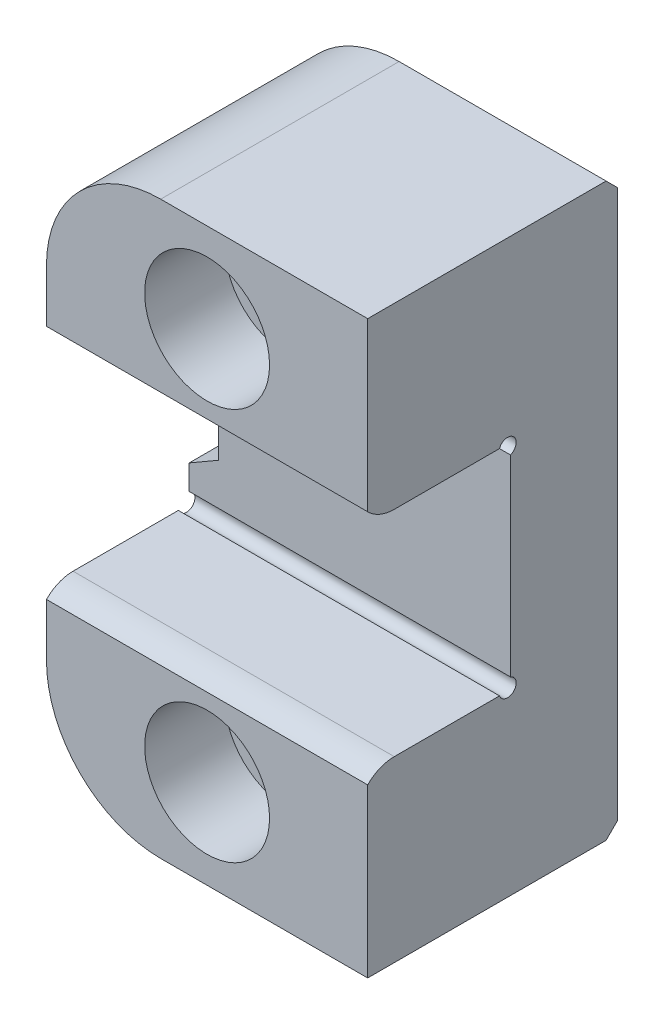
ISO-10303-21;
HEADER;
FILE_DESCRIPTION(('STEP AP214'),'2;1');
FILE_NAME('part.step','',(''),(''),'','','');
FILE_SCHEMA(('AUTOMOTIVE_DESIGN { 1 0 10303 214 1 1 1 1 }'));
ENDSEC;
DATA;
#1=APPLICATION_CONTEXT('core data for automotive mechanical design processes');
#2=APPLICATION_PROTOCOL_DEFINITION('international standard','automotive_design',2000,#1);
#3=PRODUCT_CONTEXT('',#1,'mechanical');
#4=PRODUCT('Part','Part','',(#3));
#5=PRODUCT_RELATED_PRODUCT_CATEGORY('part','',(#4));
#6=PRODUCT_DEFINITION_FORMATION('','',#4);
#7=PRODUCT_DEFINITION_CONTEXT('part definition',#1,'design');
#8=PRODUCT_DEFINITION('design','',#6,#7);
#9=PRODUCT_DEFINITION_SHAPE('','',#8);
#10=(LENGTH_UNIT() NAMED_UNIT(*) SI_UNIT(.MILLI.,.METRE.));
#11=(NAMED_UNIT(*) PLANE_ANGLE_UNIT() SI_UNIT($,.RADIAN.));
#12=(NAMED_UNIT(*) SI_UNIT($,.STERADIAN.) SOLID_ANGLE_UNIT());
#13=UNCERTAINTY_MEASURE_WITH_UNIT(LENGTH_MEASURE(1.E-05),#10,'distance_accuracy_value','');
#14=(GEOMETRIC_REPRESENTATION_CONTEXT(3) GLOBAL_UNCERTAINTY_ASSIGNED_CONTEXT((#13)) GLOBAL_UNIT_ASSIGNED_CONTEXT((#10,
#11,#12)) REPRESENTATION_CONTEXT('',''));
#15=CARTESIAN_POINT('',(0.,0.,0.));
#16=DIRECTION('',(0.,0.,1.));
#17=DIRECTION('',(1.,0.,0.));
#18=AXIS2_PLACEMENT_3D('',#15,#16,#17);
#19=CARTESIAN_POINT('',(14.2875,25.4,0.));
#20=DIRECTION('',(0.,0.,-1.));
#21=DIRECTION('',(0.,1.,0.));
#22=AXIS2_PLACEMENT_3D('',#19,#20,#21);
#23=PLANE('',#22);
#24=DIRECTION('',(0.,-1.,0.));
#25=VECTOR('',#24,1.);
#26=CARTESIAN_POINT('',(-14.2875,25.4,0.));
#27=LINE('',#26,#25);
#28=CARTESIAN_POINT('',(-14.2875,15.24,0.));
#29=VERTEX_POINT('',#28);
#30=CARTESIAN_POINT('',(-14.2875,10.5210198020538,0.));
#31=VERTEX_POINT('',#30);
#32=EDGE_CURVE('E342',#29,#31,#27,.T.);
#33=ORIENTED_EDGE('',*,*,#32,.T.);
#34=DIRECTION('',(1.,0.,0.));
#35=VECTOR('',#34,1.);
#36=CARTESIAN_POINT('',(-14.2875,10.5210198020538,0.));
#37=LINE('',#36,#35);
#38=CARTESIAN_POINT('',(14.2875,10.5210198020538,0.));
#39=VERTEX_POINT('',#38);
#40=EDGE_CURVE('E411',#31,#39,#37,.T.);
#41=ORIENTED_EDGE('',*,*,#40,.T.);
#42=DIRECTION('',(0.,-1.,0.));
#43=VECTOR('',#42,1.);
#44=CARTESIAN_POINT('',(14.2875,25.4,0.));
#45=LINE('',#44,#43);
#46=CARTESIAN_POINT('',(14.2875,25.4,0.));
#47=VERTEX_POINT('',#46);
#48=EDGE_CURVE('E218',#47,#39,#45,.T.);
#49=ORIENTED_EDGE('',*,*,#48,.F.);
#50=DIRECTION('',(-1.,0.,0.));
#51=VECTOR('',#50,1.);
#52=CARTESIAN_POINT('',(14.2875,25.4,0.));
#53=LINE('',#52,#51);
#54=CARTESIAN_POINT('',(-4.1275,25.4,0.));
#55=VERTEX_POINT('',#54);
#56=EDGE_CURVE('E225',#47,#55,#53,.T.);
#57=ORIENTED_EDGE('',*,*,#56,.T.);
#58=CARTESIAN_POINT('',(-4.1275,15.24,0.));
#59=DIRECTION('',(0.,0.,-1.));
#60=DIRECTION('',(0.,1.,0.));
#61=AXIS2_PLACEMENT_3D('',#58,#59,#60);
#62=CIRCLE('',#61,10.16);
#63=EDGE_CURVE('E243',#55,#29,#62,.F.);
#64=ORIENTED_EDGE('',*,*,#63,.T.);
#65=EDGE_LOOP('',(#33,#41,#49,#57,#64));
#66=FACE_BOUND('',#65,.T.);
#67=CARTESIAN_POINT('',(0.,17.4625,0.));
#68=DIRECTION('',(0.,0.,1.));
#69=DIRECTION('',(1.,0.,0.));
#70=AXIS2_PLACEMENT_3D('',#67,#68,#69);
#71=CIRCLE('',#70,5.55625);
#72=CARTESIAN_POINT('',(5.55625,17.4625,0.));
#73=VERTEX_POINT('',#72);
#74=EDGE_CURVE('E298',#73,#73,#71,.T.);
#75=ORIENTED_EDGE('',*,*,#74,.F.);
#76=EDGE_LOOP('',(#75));
#77=FACE_BOUND('',#76,.T.);
#78=ADVANCED_FACE('F32',(#66,#77),#23,.F.);
#79=CARTESIAN_POINT('',(14.2875,9.525,-12.7));
#80=DIRECTION('',(0.,0.,-1.));
#81=DIRECTION('',(-1.,0.,0.));
#82=AXIS2_PLACEMENT_3D('',#79,#80,#81);
#83=PLANE('',#82);
#84=DIRECTION('',(-0.866025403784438,0.500000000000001,0.));
#85=VECTOR('',#84,1.);
#86=CARTESIAN_POINT('',(5.76893467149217,-5.22958795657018,-12.7));
#87=LINE('',#86,#85);
#88=CARTESIAN_POINT('',(-11.6791135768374,4.84404739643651,-12.7));
#89=VERTEX_POINT('',#88);
#90=CARTESIAN_POINT('',(-14.2875,6.35,-12.7));
#91=VERTEX_POINT('',#90);
#92=EDGE_CURVE('E340',#89,#91,#87,.T.);
#93=ORIENTED_EDGE('',*,*,#92,.F.);
#94=DIRECTION('',(0.,-1.,0.));
#95=VECTOR('',#94,1.);
#96=CARTESIAN_POINT('',(-11.6791135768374,-5.43345644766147,-12.7));
#97=LINE('',#96,#95);
#98=CARTESIAN_POINT('',(-11.6791135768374,-4.84404739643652,-12.7));
#99=VERTEX_POINT('',#98);
#100=EDGE_CURVE('E255',#89,#99,#97,.T.);
#101=ORIENTED_EDGE('',*,*,#100,.T.);
#102=DIRECTION('',(0.866025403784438,0.500000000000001,0.));
#103=VECTOR('',#102,1.);
#104=CARTESIAN_POINT('',(14.017826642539,9.9920879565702,-12.7));
#105=LINE('',#104,#103);
#106=CARTESIAN_POINT('',(-14.2875,-6.35,-12.7));
#107=VERTEX_POINT('',#106);
#108=EDGE_CURVE('E338',#107,#99,#105,.T.);
#109=ORIENTED_EDGE('',*,*,#108,.F.);
#110=DIRECTION('',(0.,-1.,0.));
#111=VECTOR('',#110,1.);
#112=CARTESIAN_POINT('',(-14.2875,9.525,-12.7));
#113=LINE('',#112,#111);
#114=CARTESIAN_POINT('',(-14.2875,-8.55257951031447,-12.7));
#115=VERTEX_POINT('',#114);
#116=EDGE_CURVE('E221',#107,#115,#113,.T.);
#117=ORIENTED_EDGE('',*,*,#116,.T.);
#118=DIRECTION('',(1.,0.,0.));
#119=VECTOR('',#118,1.);
#120=CARTESIAN_POINT('',(-14.2875,-8.55257951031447,-12.7));
#121=LINE('',#120,#119);
#122=CARTESIAN_POINT('',(14.2875,-8.55257951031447,-12.7));
#123=VERTEX_POINT('',#122);
#124=EDGE_CURVE('E194',#115,#123,#121,.T.);
#125=ORIENTED_EDGE('',*,*,#124,.T.);
#126=DIRECTION('',(0.,-1.,0.));
#127=VECTOR('',#126,1.);
#128=CARTESIAN_POINT('',(14.2875,9.525,-12.7));
#129=LINE('',#128,#127);
#130=CARTESIAN_POINT('',(14.2875,8.55257951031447,-12.7));
#131=VERTEX_POINT('',#130);
#132=EDGE_CURVE('E348',#131,#123,#129,.T.);
#133=ORIENTED_EDGE('',*,*,#132,.F.);
#134=DIRECTION('',(1.,0.,0.));
#135=VECTOR('',#134,1.);
#136=CARTESIAN_POINT('',(-14.2875,8.55257951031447,-12.7));
#137=LINE('',#136,#135);
#138=CARTESIAN_POINT('',(-14.2875,8.55257951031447,-12.7));
#139=VERTEX_POINT('',#138);
#140=EDGE_CURVE('E417',#131,#139,#137,.F.);
#141=ORIENTED_EDGE('',*,*,#140,.T.);
#142=EDGE_CURVE('E215',#139,#91,#113,.T.);
#143=ORIENTED_EDGE('',*,*,#142,.T.);
#144=EDGE_LOOP('',(#93,#101,#109,#117,#125,#133,#141,#143));
#145=FACE_BOUND('',#144,.T.);
#146=ADVANCED_FACE('F370',(#145),#83,.F.);
#147=CARTESIAN_POINT('',(14.2875,25.4,-22.225));
#148=DIRECTION('',(0.,0.,1.));
#149=DIRECTION('',(1.,0.,0.));
#150=AXIS2_PLACEMENT_3D('',#147,#148,#149);
#151=PLANE('',#150);
#152=CARTESIAN_POINT('',(0.,17.4625,-22.225));
#153=DIRECTION('',(0.,0.,1.));
#154=DIRECTION('',(1.,0.,0.));
#155=AXIS2_PLACEMENT_3D('',#152,#153,#154);
#156=CIRCLE('',#155,3.57123999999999);
#157=CARTESIAN_POINT('',(3.57123999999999,17.4625,-22.225));
#158=VERTEX_POINT('',#157);
#159=EDGE_CURVE('E725',#158,#158,#156,.T.);
#160=ORIENTED_EDGE('',*,*,#159,.T.);
#161=EDGE_LOOP('',(#160));
#162=FACE_BOUND('',#161,.T.);
#163=CARTESIAN_POINT('',(0.,-17.4625,-22.225));
#164=DIRECTION('',(0.,0.,1.));
#165=DIRECTION('',(1.,0.,0.));
#166=AXIS2_PLACEMENT_3D('',#163,#164,#165);
#167=CIRCLE('',#166,3.57123999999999);
#168=CARTESIAN_POINT('',(3.57123999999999,-17.4625,-22.225));
#169=VERTEX_POINT('',#168);
#170=EDGE_CURVE('E728',#169,#169,#167,.T.);
#171=ORIENTED_EDGE('',*,*,#170,.T.);
#172=EDGE_LOOP('',(#171));
#173=FACE_BOUND('',#172,.T.);
#174=CARTESIAN_POINT('',(-4.1275,-15.24,-22.225));
#175=DIRECTION('',(0.,0.,1.));
#176=DIRECTION('',(1.,0.,0.));
#177=AXIS2_PLACEMENT_3D('',#174,#175,#176);
#178=CIRCLE('',#177,9.144);
#179=CARTESIAN_POINT('',(-4.1275,-24.384,-22.225));
#180=VERTEX_POINT('',#179);
#181=CARTESIAN_POINT('',(-13.2715,-15.24,-22.225));
#182=VERTEX_POINT('',#181);
#183=EDGE_CURVE('E271',#180,#182,#178,.F.);
#184=ORIENTED_EDGE('',*,*,#183,.T.);
#185=DIRECTION('',(0.,1.,0.));
#186=VECTOR('',#185,1.);
#187=CARTESIAN_POINT('',(-13.2715,-6.35,-22.225));
#188=LINE('',#187,#186);
#189=CARTESIAN_POINT('',(-13.2715,-5.76341212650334,-22.225));
#190=VERTEX_POINT('',#189);
#191=EDGE_CURVE('E273',#182,#190,#188,.T.);
#192=ORIENTED_EDGE('',*,*,#191,.T.);
#193=DIRECTION('',(0.866025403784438,0.500000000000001,0.));
#194=VECTOR('',#193,1.);
#195=CARTESIAN_POINT('',(-12.7,-5.43345644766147,-22.225));
#196=LINE('',#195,#194);
#197=CARTESIAN_POINT('',(-12.7,-5.43345644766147,-22.225));
#198=VERTEX_POINT('',#197);
#199=EDGE_CURVE('E324',#190,#198,#196,.T.);
#200=ORIENTED_EDGE('',*,*,#199,.T.);
#201=DIRECTION('',(0.,1.,0.));
#202=VECTOR('',#201,1.);
#203=CARTESIAN_POINT('',(-12.7,5.43345644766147,-22.225));
#204=LINE('',#203,#202);
#205=CARTESIAN_POINT('',(-12.7,5.43345644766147,-22.225));
#206=VERTEX_POINT('',#205);
#207=EDGE_CURVE('E323',#198,#206,#204,.T.);
#208=ORIENTED_EDGE('',*,*,#207,.T.);
#209=DIRECTION('',(-0.866025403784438,0.500000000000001,0.));
#210=VECTOR('',#209,1.);
#211=CARTESIAN_POINT('',(-12.7,5.43345644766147,-22.225));
#212=LINE('',#211,#210);
#213=CARTESIAN_POINT('',(-13.2715,5.76341212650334,-22.225));
#214=VERTEX_POINT('',#213);
#215=EDGE_CURVE('E317',#206,#214,#212,.T.);
#216=ORIENTED_EDGE('',*,*,#215,.T.);
#217=DIRECTION('',(0.,1.,0.));
#218=VECTOR('',#217,1.);
#219=CARTESIAN_POINT('',(-13.2715,15.24,-22.225));
#220=LINE('',#219,#218);
#221=CARTESIAN_POINT('',(-13.2715,15.24,-22.225));
#222=VERTEX_POINT('',#221);
#223=EDGE_CURVE('E265',#214,#222,#220,.T.);
#224=ORIENTED_EDGE('',*,*,#223,.T.);
#225=CARTESIAN_POINT('',(-4.1275,15.24,-22.225));
#226=DIRECTION('',(0.,0.,1.));
#227=DIRECTION('',(1.,0.,0.));
#228=AXIS2_PLACEMENT_3D('',#225,#226,#227);
#229=CIRCLE('',#228,9.14399999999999);
#230=CARTESIAN_POINT('',(-4.1275,24.384,-22.225));
#231=VERTEX_POINT('',#230);
#232=EDGE_CURVE('E263',#222,#231,#229,.F.);
#233=ORIENTED_EDGE('',*,*,#232,.T.);
#234=DIRECTION('',(1.,0.,0.));
#235=VECTOR('',#234,1.);
#236=CARTESIAN_POINT('',(14.2875,24.384,-22.225));
#237=LINE('',#236,#235);
#238=CARTESIAN_POINT('',(14.2875,24.384,-22.225));
#239=VERTEX_POINT('',#238);
#240=EDGE_CURVE('E267',#231,#239,#237,.T.);
#241=ORIENTED_EDGE('',*,*,#240,.T.);
#242=DIRECTION('',(0.,1.,0.));
#243=VECTOR('',#242,1.);
#244=CARTESIAN_POINT('',(14.2875,25.4,-22.225));
#245=LINE('',#244,#243);
#246=CARTESIAN_POINT('',(14.2875,-24.384,-22.225));
#247=VERTEX_POINT('',#246);
#248=EDGE_CURVE('E357',#247,#239,#245,.T.);
#249=ORIENTED_EDGE('',*,*,#248,.F.);
#250=DIRECTION('',(-1.,0.,0.));
#251=VECTOR('',#250,1.);
#252=CARTESIAN_POINT('',(14.2875,-24.384,-22.225));
#253=LINE('',#252,#251);
#254=EDGE_CURVE('E269',#247,#180,#253,.T.);
#255=ORIENTED_EDGE('',*,*,#254,.T.);
#256=EDGE_LOOP('',(#184,#192,#200,#208,#216,#224,#233,#241,#249,#255));
#257=FACE_BOUND('',#256,.T.);
#258=ADVANCED_FACE('F321',(#162,#173,#257),#151,.F.);
#259=CARTESIAN_POINT('',(-14.2875,-9.525,0.));
#260=DIRECTION('',(-1.,0.,0.));
#261=DIRECTION('',(0.,0.,1.));
#262=AXIS2_PLACEMENT_3D('',#259,#260,#261);
#263=PLANE('',#262);
#264=DIRECTION('',(0.,0.,1.));
#265=VECTOR('',#264,1.);
#266=CARTESIAN_POINT('',(-14.2875,15.24,-22.225));
#267=LINE('',#266,#265);
#268=CARTESIAN_POINT('',(-14.2875,15.24,-21.209));
#269=VERTEX_POINT('',#268);
#270=EDGE_CURVE('E235',#29,#269,#267,.F.);
#271=ORIENTED_EDGE('',*,*,#270,.T.);
#272=DIRECTION('',(0.,-1.,0.));
#273=VECTOR('',#272,1.);
#274=CARTESIAN_POINT('',(-14.2875,6.35,-21.209));
#275=LINE('',#274,#273);
#276=CARTESIAN_POINT('',(-14.2875,6.35,-21.209));
#277=VERTEX_POINT('',#276);
#278=EDGE_CURVE('E49',#269,#277,#275,.T.);
#279=ORIENTED_EDGE('',*,*,#278,.T.);
#280=DIRECTION('',(0.,0.,1.));
#281=VECTOR('',#280,1.);
#282=CARTESIAN_POINT('',(-14.2875,6.35,0.));
#283=LINE('',#282,#281);
#284=EDGE_CURVE('E247',#277,#91,#283,.T.);
#285=ORIENTED_EDGE('',*,*,#284,.T.);
#286=ORIENTED_EDGE('',*,*,#142,.F.);
#287=CARTESIAN_POINT('',(-14.2875,9.271,-12.446));
#288=DIRECTION('',(1.,0.,0.));
#289=DIRECTION('',(0.,0.,-1.));
#290=AXIS2_PLACEMENT_3D('',#287,#288,#289);
#291=CIRCLE('',#290,0.762000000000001);
#292=CARTESIAN_POINT('',(-14.2875,9.525,-11.7275795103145));
#293=VERTEX_POINT('',#292);
#294=EDGE_CURVE('E424',#139,#293,#291,.T.);
#295=ORIENTED_EDGE('',*,*,#294,.T.);
#296=DIRECTION('',(0.,0.,-1.));
#297=VECTOR('',#296,1.);
#298=CARTESIAN_POINT('',(-14.2875,9.525,0.));
#299=LINE('',#298,#297);
#300=CARTESIAN_POINT('',(-14.2875,9.525,-2.36219999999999));
#301=VERTEX_POINT('',#300);
#302=EDGE_CURVE('E362',#301,#293,#299,.T.);
#303=ORIENTED_EDGE('',*,*,#302,.F.);
#304=CARTESIAN_POINT('',(-14.2875,12.8241534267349,-2.36219999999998));
#305=DIRECTION('',(-1.,0.,0.));
#306=DIRECTION('',(0.,0.,-1.));
#307=AXIS2_PLACEMENT_3D('',#304,#305,#306);
#308=CIRCLE('',#307,3.29915342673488);
#309=EDGE_CURVE('E416',#301,#31,#308,.T.);
#310=ORIENTED_EDGE('',*,*,#309,.T.);
#311=ORIENTED_EDGE('',*,*,#32,.F.);
#312=EDGE_LOOP('',(#271,#279,#285,#286,#295,#303,#310,#311));
#313=FACE_BOUND('',#312,.T.);
#314=ADVANCED_FACE('F634',(#313),#263,.T.);
#315=DIRECTION('',(0.,0.,-1.));
#316=VECTOR('',#315,1.);
#317=CARTESIAN_POINT('',(-14.2875,-6.35,0.));
#318=LINE('',#317,#316);
#319=CARTESIAN_POINT('',(-14.2875,-6.35,-21.209));
#320=VERTEX_POINT('',#319);
#321=EDGE_CURVE('E245',#107,#320,#318,.T.);
#322=ORIENTED_EDGE('',*,*,#321,.T.);
#323=DIRECTION('',(0.,-1.,0.));
#324=VECTOR('',#323,1.);
#325=CARTESIAN_POINT('',(-14.2875,-15.24,-21.209));
#326=LINE('',#325,#324);
#327=CARTESIAN_POINT('',(-14.2875,-15.24,-21.209));
#328=VERTEX_POINT('',#327);
#329=EDGE_CURVE('E278',#320,#328,#326,.T.);
#330=ORIENTED_EDGE('',*,*,#329,.T.);
#331=DIRECTION('',(0.,0.,-1.));
#332=VECTOR('',#331,1.);
#333=CARTESIAN_POINT('',(-14.2875,-15.24,0.));
#334=LINE('',#333,#332);
#335=CARTESIAN_POINT('',(-14.2875,-15.24,0.));
#336=VERTEX_POINT('',#335);
#337=EDGE_CURVE('E237',#328,#336,#334,.F.);
#338=ORIENTED_EDGE('',*,*,#337,.T.);
#339=DIRECTION('',(0.,-1.,0.));
#340=VECTOR('',#339,1.);
#341=CARTESIAN_POINT('',(-14.2875,-9.525,0.));
#342=LINE('',#341,#340);
#343=CARTESIAN_POINT('',(-14.2875,-10.5210198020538,0.));
#344=VERTEX_POINT('',#343);
#345=EDGE_CURVE('E214',#344,#336,#342,.T.);
#346=ORIENTED_EDGE('',*,*,#345,.F.);
#347=CARTESIAN_POINT('',(-14.2875,-12.8241534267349,-2.36219999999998));
#348=DIRECTION('',(-1.,0.,0.));
#349=DIRECTION('',(0.,0.,1.));
#350=AXIS2_PLACEMENT_3D('',#347,#348,#349);
#351=CIRCLE('',#350,3.29915342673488);
#352=CARTESIAN_POINT('',(-14.2875,-9.525,-2.36219999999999));
#353=VERTEX_POINT('',#352);
#354=EDGE_CURVE('E213',#344,#353,#351,.T.);
#355=ORIENTED_EDGE('',*,*,#354,.T.);
#356=DIRECTION('',(0.,0.,1.));
#357=VECTOR('',#356,1.);
#358=CARTESIAN_POINT('',(-14.2875,-9.525,-12.7));
#359=LINE('',#358,#357);
#360=CARTESIAN_POINT('',(-14.2875,-9.525,-11.7275795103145));
#361=VERTEX_POINT('',#360);
#362=EDGE_CURVE('E205',#361,#353,#359,.T.);
#363=ORIENTED_EDGE('',*,*,#362,.F.);
#364=CARTESIAN_POINT('',(-14.2875,-9.271,-12.446));
#365=DIRECTION('',(1.,0.,0.));
#366=DIRECTION('',(0.,0.,1.));
#367=AXIS2_PLACEMENT_3D('',#364,#365,#366);
#368=CIRCLE('',#367,0.762000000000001);
#369=EDGE_CURVE('E188',#361,#115,#368,.T.);
#370=ORIENTED_EDGE('',*,*,#369,.T.);
#371=ORIENTED_EDGE('',*,*,#116,.F.);
#372=EDGE_LOOP('',(#322,#330,#338,#346,#355,#363,#370,#371));
#373=FACE_BOUND('',#372,.T.);
#374=ADVANCED_FACE('F211',(#373),#263,.T.);
#375=CARTESIAN_POINT('',(14.2875,9.525,0.));
#376=DIRECTION('',(0.,1.,0.));
#377=DIRECTION('',(0.,0.,1.));
#378=AXIS2_PLACEMENT_3D('',#375,#376,#377);
#379=PLANE('',#378);
#380=ORIENTED_EDGE('',*,*,#302,.T.);
#381=DIRECTION('',(1.,0.,0.));
#382=VECTOR('',#381,1.);
#383=CARTESIAN_POINT('',(-14.2875,9.525,-11.7275795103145));
#384=LINE('',#383,#382);
#385=CARTESIAN_POINT('',(14.2875,9.525,-11.7275795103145));
#386=VERTEX_POINT('',#385);
#387=EDGE_CURVE('E421',#293,#386,#384,.T.);
#388=ORIENTED_EDGE('',*,*,#387,.T.);
#389=DIRECTION('',(0.,0.,-1.));
#390=VECTOR('',#389,1.);
#391=CARTESIAN_POINT('',(14.2875,9.525,0.));
#392=LINE('',#391,#390);
#393=CARTESIAN_POINT('',(14.2875,9.525,-2.36219999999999));
#394=VERTEX_POINT('',#393);
#395=EDGE_CURVE('E345',#394,#386,#392,.T.);
#396=ORIENTED_EDGE('',*,*,#395,.F.);
#397=DIRECTION('',(1.,0.,0.));
#398=VECTOR('',#397,1.);
#399=CARTESIAN_POINT('',(-14.2875,9.525,-2.36219999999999));
#400=LINE('',#399,#398);
#401=EDGE_CURVE('E420',#301,#394,#400,.T.);
#402=ORIENTED_EDGE('',*,*,#401,.F.);
#403=EDGE_LOOP('',(#380,#388,#396,#402));
#404=FACE_BOUND('',#403,.T.);
#405=ADVANCED_FACE('F419',(#404),#379,.F.);
#406=CARTESIAN_POINT('',(14.2875,-9.525,-12.7));
#407=DIRECTION('',(0.,-1.,0.));
#408=DIRECTION('',(0.,0.,-1.));
#409=AXIS2_PLACEMENT_3D('',#406,#407,#408);
#410=PLANE('',#409);
#411=DIRECTION('',(0.,0.,1.));
#412=VECTOR('',#411,1.);
#413=CARTESIAN_POINT('',(14.2875,-9.525,-12.7));
#414=LINE('',#413,#412);
#415=CARTESIAN_POINT('',(14.2875,-9.525,-11.7275795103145));
#416=VERTEX_POINT('',#415);
#417=CARTESIAN_POINT('',(14.2875,-9.525,-2.36219999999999));
#418=VERTEX_POINT('',#417);
#419=EDGE_CURVE('E207',#416,#418,#414,.T.);
#420=ORIENTED_EDGE('',*,*,#419,.F.);
#421=DIRECTION('',(1.,0.,0.));
#422=VECTOR('',#421,1.);
#423=CARTESIAN_POINT('',(-14.2875,-9.525,-11.7275795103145));
#424=LINE('',#423,#422);
#425=EDGE_CURVE('E191',#416,#361,#424,.F.);
#426=ORIENTED_EDGE('',*,*,#425,.T.);
#427=ORIENTED_EDGE('',*,*,#362,.T.);
#428=DIRECTION('',(1.,0.,0.));
#429=VECTOR('',#428,1.);
#430=CARTESIAN_POINT('',(-14.2875,-9.525,-2.36219999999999));
#431=LINE('',#430,#429);
#432=EDGE_CURVE('E328',#353,#418,#431,.T.);
#433=ORIENTED_EDGE('',*,*,#432,.T.);
#434=EDGE_LOOP('',(#420,#426,#427,#433));
#435=FACE_BOUND('',#434,.T.);
#436=ADVANCED_FACE('F203',(#435),#410,.F.);
#437=CARTESIAN_POINT('',(14.2875,-9.525,0.));
#438=DIRECTION('',(0.,0.,-1.));
#439=DIRECTION('',(0.,1.,0.));
#440=AXIS2_PLACEMENT_3D('',#437,#438,#439);
#441=PLANE('',#440);
#442=CARTESIAN_POINT('',(0.,-17.4625,0.));
#443=DIRECTION('',(0.,0.,1.));
#444=DIRECTION('',(1.,0.,0.));
#445=AXIS2_PLACEMENT_3D('',#442,#443,#444);
#446=CIRCLE('',#445,5.55625);
#447=CARTESIAN_POINT('',(5.55625,-17.4625,0.));
#448=VERTEX_POINT('',#447);
#449=EDGE_CURVE('E738',#448,#448,#446,.T.);
#450=ORIENTED_EDGE('',*,*,#449,.F.);
#451=EDGE_LOOP('',(#450));
#452=FACE_BOUND('',#451,.T.);
#453=DIRECTION('',(0.,-1.,0.));
#454=VECTOR('',#453,1.);
#455=CARTESIAN_POINT('',(14.2875,-9.525,0.));
#456=LINE('',#455,#454);
#457=CARTESIAN_POINT('',(14.2875,-10.5210198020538,0.));
#458=VERTEX_POINT('',#457);
#459=CARTESIAN_POINT('',(14.2875,-25.4,0.));
#460=VERTEX_POINT('',#459);
#461=EDGE_CURVE('E352',#458,#460,#456,.T.);
#462=ORIENTED_EDGE('',*,*,#461,.F.);
#463=DIRECTION('',(1.,0.,0.));
#464=VECTOR('',#463,1.);
#465=CARTESIAN_POINT('',(-14.2875,-10.5210198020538,0.));
#466=LINE('',#465,#464);
#467=EDGE_CURVE('E325',#344,#458,#466,.T.);
#468=ORIENTED_EDGE('',*,*,#467,.F.);
#469=ORIENTED_EDGE('',*,*,#345,.T.);
#470=CARTESIAN_POINT('',(-4.1275,-15.24,0.));
#471=DIRECTION('',(0.,0.,-1.));
#472=DIRECTION('',(0.,1.,0.));
#473=AXIS2_PLACEMENT_3D('',#470,#471,#472);
#474=CIRCLE('',#473,10.16);
#475=CARTESIAN_POINT('',(-4.1275,-25.4,0.));
#476=VERTEX_POINT('',#475);
#477=EDGE_CURVE('E239',#336,#476,#474,.F.);
#478=ORIENTED_EDGE('',*,*,#477,.T.);
#479=DIRECTION('',(-1.,0.,0.));
#480=VECTOR('',#479,1.);
#481=CARTESIAN_POINT('',(14.2875,-25.4,0.));
#482=LINE('',#481,#480);
#483=EDGE_CURVE('E228',#460,#476,#482,.T.);
#484=ORIENTED_EDGE('',*,*,#483,.F.);
#485=EDGE_LOOP('',(#462,#468,#469,#478,#484));
#486=FACE_BOUND('',#485,.T.);
#487=ADVANCED_FACE('F444',(#452,#486),#441,.F.);
#488=CARTESIAN_POINT('',(14.2875,-25.4,0.));
#489=DIRECTION('',(0.,1.,0.));
#490=DIRECTION('',(0.,0.,1.));
#491=AXIS2_PLACEMENT_3D('',#488,#489,#490);
#492=PLANE('',#491);
#493=DIRECTION('',(0.,0.,-1.));
#494=VECTOR('',#493,1.);
#495=CARTESIAN_POINT('',(-4.1275,-25.4,-22.225));
#496=LINE('',#495,#494);
#497=CARTESIAN_POINT('',(-4.1275,-25.4,-21.209));
#498=VERTEX_POINT('',#497);
#499=EDGE_CURVE('E232',#476,#498,#496,.T.);
#500=ORIENTED_EDGE('',*,*,#499,.T.);
#501=DIRECTION('',(1.,0.,0.));
#502=VECTOR('',#501,1.);
#503=CARTESIAN_POINT('',(14.2875,-25.4,-21.209));
#504=LINE('',#503,#502);
#505=CARTESIAN_POINT('',(14.2875,-25.4,-21.209));
#506=VERTEX_POINT('',#505);
#507=EDGE_CURVE('E282',#498,#506,#504,.T.);
#508=ORIENTED_EDGE('',*,*,#507,.T.);
#509=DIRECTION('',(0.,0.,-1.));
#510=VECTOR('',#509,1.);
#511=CARTESIAN_POINT('',(14.2875,-25.4,0.));
#512=LINE('',#511,#510);
#513=EDGE_CURVE('E354',#460,#506,#512,.T.);
#514=ORIENTED_EDGE('',*,*,#513,.F.);
#515=ORIENTED_EDGE('',*,*,#483,.T.);
#516=EDGE_LOOP('',(#500,#508,#514,#515));
#517=FACE_BOUND('',#516,.T.);
#518=ADVANCED_FACE('F390',(#517),#492,.F.);
#519=CARTESIAN_POINT('',(14.2875,25.4,0.));
#520=DIRECTION('',(0.,-1.,0.));
#521=DIRECTION('',(0.,0.,-1.));
#522=AXIS2_PLACEMENT_3D('',#519,#520,#521);
#523=PLANE('',#522);
#524=DIRECTION('',(0.,0.,1.));
#525=VECTOR('',#524,1.);
#526=CARTESIAN_POINT('',(14.2875,25.4,0.));
#527=LINE('',#526,#525);
#528=CARTESIAN_POINT('',(14.2875,25.4,-21.209));
#529=VERTEX_POINT('',#528);
#530=EDGE_CURVE('E229',#529,#47,#527,.T.);
#531=ORIENTED_EDGE('',*,*,#530,.F.);
#532=DIRECTION('',(-1.,0.,0.));
#533=VECTOR('',#532,1.);
#534=CARTESIAN_POINT('',(14.2875,25.4,-21.209));
#535=LINE('',#534,#533);
#536=CARTESIAN_POINT('',(-4.1275,25.4,-21.209));
#537=VERTEX_POINT('',#536);
#538=EDGE_CURVE('E288',#529,#537,#535,.T.);
#539=ORIENTED_EDGE('',*,*,#538,.T.);
#540=DIRECTION('',(0.,0.,1.));
#541=VECTOR('',#540,1.);
#542=CARTESIAN_POINT('',(-4.1275,25.4,0.));
#543=LINE('',#542,#541);
#544=EDGE_CURVE('E241',#537,#55,#543,.T.);
#545=ORIENTED_EDGE('',*,*,#544,.T.);
#546=ORIENTED_EDGE('',*,*,#56,.F.);
#547=EDGE_LOOP('',(#531,#539,#545,#546));
#548=FACE_BOUND('',#547,.T.);
#549=ADVANCED_FACE('F405',(#548),#523,.F.);
#550=CARTESIAN_POINT('',(14.2875,-9.525,0.));
#551=DIRECTION('',(-1.,0.,0.));
#552=DIRECTION('',(0.,0.,1.));
#553=AXIS2_PLACEMENT_3D('',#550,#551,#552);
#554=PLANE('',#553);
#555=ORIENTED_EDGE('',*,*,#513,.T.);
#556=DIRECTION('',(0.,-0.707106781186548,0.707106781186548));
#557=VECTOR('',#556,1.);
#558=CARTESIAN_POINT('',(14.2875,-24.384,-22.225));
#559=LINE('',#558,#557);
#560=EDGE_CURVE('E286',#506,#247,#559,.F.);
#561=ORIENTED_EDGE('',*,*,#560,.T.);
#562=ORIENTED_EDGE('',*,*,#248,.T.);
#563=DIRECTION('',(0.,-0.707106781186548,-0.707106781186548));
#564=VECTOR('',#563,1.);
#565=CARTESIAN_POINT('',(14.2875,25.4,-21.209));
#566=LINE('',#565,#564);
#567=EDGE_CURVE('E284',#239,#529,#566,.F.);
#568=ORIENTED_EDGE('',*,*,#567,.T.);
#569=ORIENTED_EDGE('',*,*,#530,.T.);
#570=ORIENTED_EDGE('',*,*,#48,.T.);
#571=CARTESIAN_POINT('',(14.2875,12.8241534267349,-2.36219999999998));
#572=DIRECTION('',(-1.,0.,0.));
#573=DIRECTION('',(0.,0.,-1.));
#574=AXIS2_PLACEMENT_3D('',#571,#572,#573);
#575=CIRCLE('',#574,3.29915342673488);
#576=EDGE_CURVE('E413',#394,#39,#575,.T.);
#577=ORIENTED_EDGE('',*,*,#576,.F.);
#578=ORIENTED_EDGE('',*,*,#395,.T.);
#579=CARTESIAN_POINT('',(14.2875,9.271,-12.446));
#580=DIRECTION('',(-1.,0.,0.));
#581=DIRECTION('',(0.,0.,1.));
#582=AXIS2_PLACEMENT_3D('',#579,#580,#581);
#583=CIRCLE('',#582,0.762000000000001);
#584=EDGE_CURVE('E249',#386,#131,#583,.T.);
#585=ORIENTED_EDGE('',*,*,#584,.T.);
#586=ORIENTED_EDGE('',*,*,#132,.T.);
#587=CARTESIAN_POINT('',(14.2875,-9.271,-12.446));
#588=DIRECTION('',(1.,0.,0.));
#589=DIRECTION('',(0.,0.,1.));
#590=AXIS2_PLACEMENT_3D('',#587,#588,#589);
#591=CIRCLE('',#590,0.762000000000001);
#592=EDGE_CURVE('E199',#416,#123,#591,.T.);
#593=ORIENTED_EDGE('',*,*,#592,.F.);
#594=ORIENTED_EDGE('',*,*,#419,.T.);
#595=CARTESIAN_POINT('',(14.2875,-12.8241534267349,-2.36219999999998));
#596=DIRECTION('',(-1.,0.,0.));
#597=DIRECTION('',(0.,0.,1.));
#598=AXIS2_PLACEMENT_3D('',#595,#596,#597);
#599=CIRCLE('',#598,3.29915342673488);
#600=EDGE_CURVE('E434',#458,#418,#599,.T.);
#601=ORIENTED_EDGE('',*,*,#600,.F.);
#602=ORIENTED_EDGE('',*,*,#461,.T.);
#603=EDGE_LOOP('',(#555,#561,#562,#568,#569,#570,#577,#578,#585,#586,#593,#594,#601,#602));
#604=FACE_BOUND('',#603,.T.);
#605=ADVANCED_FACE('F399',(#604),#554,.F.);
#606=CARTESIAN_POINT('',(-4.1275,-15.24,0.));
#607=DIRECTION('',(0.,0.,1.));
#608=DIRECTION('',(1.,0.,0.));
#609=AXIS2_PLACEMENT_3D('',#606,#607,#608);
#610=CYLINDRICAL_SURFACE('',#609,10.16);
#611=ORIENTED_EDGE('',*,*,#337,.F.);
#612=CARTESIAN_POINT('',(-4.1275,-15.24,-21.209));
#613=DIRECTION('',(0.,0.,1.));
#614=DIRECTION('',(1.,0.,0.));
#615=AXIS2_PLACEMENT_3D('',#612,#613,#614);
#616=CIRCLE('',#615,10.16);
#617=EDGE_CURVE('E280',#328,#498,#616,.T.);
#618=ORIENTED_EDGE('',*,*,#617,.T.);
#619=ORIENTED_EDGE('',*,*,#499,.F.);
#620=ORIENTED_EDGE('',*,*,#477,.F.);
#621=EDGE_LOOP('',(#611,#618,#619,#620));
#622=FACE_BOUND('',#621,.T.);
#623=ADVANCED_FACE('F386',(#622),#610,.T.);
#624=CARTESIAN_POINT('',(-4.1275,15.24,0.));
#625=DIRECTION('',(0.,0.,-1.));
#626=DIRECTION('',(-1.,0.,0.));
#627=AXIS2_PLACEMENT_3D('',#624,#625,#626);
#628=CYLINDRICAL_SURFACE('',#627,10.16);
#629=ORIENTED_EDGE('',*,*,#544,.F.);
#630=CARTESIAN_POINT('',(-4.1275,15.24,-21.209));
#631=DIRECTION('',(0.,0.,1.));
#632=DIRECTION('',(1.,0.,0.));
#633=AXIS2_PLACEMENT_3D('',#630,#631,#632);
#634=CIRCLE('',#633,10.16);
#635=EDGE_CURVE('E11',#537,#269,#634,.T.);
#636=ORIENTED_EDGE('',*,*,#635,.T.);
#637=ORIENTED_EDGE('',*,*,#270,.F.);
#638=ORIENTED_EDGE('',*,*,#63,.F.);
#639=EDGE_LOOP('',(#629,#636,#637,#638));
#640=FACE_BOUND('',#639,.T.);
#641=ADVANCED_FACE('F465',(#640),#628,.T.);
#642=CARTESIAN_POINT('',(-12.7,5.43345644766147,0.));
#643=DIRECTION('',(-1.,0.,0.));
#644=DIRECTION('',(0.,0.,1.));
#645=AXIS2_PLACEMENT_3D('',#642,#643,#644);
#646=PLANE('',#645);
#647=DIRECTION('',(0.,0.,-1.));
#648=VECTOR('',#647,1.);
#649=CARTESIAN_POINT('',(-12.7,-5.43345644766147,0.));
#650=LINE('',#649,#648);
#651=CARTESIAN_POINT('',(-12.7,-5.43345644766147,-16.5100000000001));
#652=VERTEX_POINT('',#651);
#653=EDGE_CURVE('E335',#652,#198,#650,.T.);
#654=ORIENTED_EDGE('',*,*,#653,.F.);
#655=DIRECTION('',(0.,1.,0.));
#656=VECTOR('',#655,1.);
#657=CARTESIAN_POINT('',(-12.7,5.43345644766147,-16.5100000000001));
#658=LINE('',#657,#656);
#659=CARTESIAN_POINT('',(-12.7,5.43345644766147,-16.5100000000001));
#660=VERTEX_POINT('',#659);
#661=EDGE_CURVE('E252',#652,#660,#658,.T.);
#662=ORIENTED_EDGE('',*,*,#661,.T.);
#663=DIRECTION('',(0.,0.,-1.));
#664=VECTOR('',#663,1.);
#665=CARTESIAN_POINT('',(-12.7,5.43345644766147,0.));
#666=LINE('',#665,#664);
#667=EDGE_CURVE('E333',#660,#206,#666,.T.);
#668=ORIENTED_EDGE('',*,*,#667,.T.);
#669=ORIENTED_EDGE('',*,*,#207,.F.);
#670=EDGE_LOOP('',(#654,#662,#668,#669));
#671=FACE_BOUND('',#670,.T.);
#672=ADVANCED_FACE('F468',(#671),#646,.T.);
#673=CARTESIAN_POINT('',(-12.7,5.43345644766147,0.));
#674=DIRECTION('',(-0.500000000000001,-0.866025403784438,0.));
#675=DIRECTION('',(0.866025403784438,-0.500000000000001,0.));
#676=AXIS2_PLACEMENT_3D('',#673,#674,#675);
#677=PLANE('',#676);
#678=ORIENTED_EDGE('',*,*,#284,.F.);
#679=DIRECTION('',(0.654653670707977,-0.377964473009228,-0.654653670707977));
#680=VECTOR('',#679,1.);
#681=CARTESIAN_POINT('',(-22.4699285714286,11.0741273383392,-13.0265714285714));
#682=LINE('',#681,#680);
#683=EDGE_CURVE('E41',#277,#214,#682,.T.);
#684=ORIENTED_EDGE('',*,*,#683,.T.);
#685=ORIENTED_EDGE('',*,*,#215,.F.);
#686=ORIENTED_EDGE('',*,*,#667,.F.);
#687=DIRECTION('',(0.255976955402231,-0.147788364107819,0.955319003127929));
#688=VECTOR('',#687,1.);
#689=CARTESIAN_POINT('',(-12.7,5.43345644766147,-16.5100000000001));
#690=LINE('',#689,#688);
#691=EDGE_CURVE('E258',#660,#89,#690,.T.);
#692=ORIENTED_EDGE('',*,*,#691,.T.);
#693=ORIENTED_EDGE('',*,*,#92,.T.);
#694=EDGE_LOOP('',(#678,#684,#685,#686,#692,#693));
#695=FACE_BOUND('',#694,.T.);
#696=ADVANCED_FACE('F315',(#695),#677,.T.);
#697=CARTESIAN_POINT('',(-12.7,-5.43345644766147,0.));
#698=DIRECTION('',(-0.500000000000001,0.866025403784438,0.));
#699=DIRECTION('',(-0.866025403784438,-0.500000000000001,0.));
#700=AXIS2_PLACEMENT_3D('',#697,#698,#699);
#701=PLANE('',#700);
#702=ORIENTED_EDGE('',*,*,#199,.F.);
#703=DIRECTION('',(-0.654653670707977,-0.377964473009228,0.654653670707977));
#704=VECTOR('',#703,1.);
#705=CARTESIAN_POINT('',(-22.4699285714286,-11.0741273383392,-13.0265714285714));
#706=LINE('',#705,#704);
#707=EDGE_CURVE('E276',#190,#320,#706,.T.);
#708=ORIENTED_EDGE('',*,*,#707,.T.);
#709=ORIENTED_EDGE('',*,*,#321,.F.);
#710=ORIENTED_EDGE('',*,*,#108,.T.);
#711=DIRECTION('',(-0.255976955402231,-0.147788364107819,-0.955319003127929));
#712=VECTOR('',#711,1.);
#713=CARTESIAN_POINT('',(-12.2889001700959,-5.19610785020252,-14.975754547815));
#714=LINE('',#713,#712);
#715=EDGE_CURVE('E261',#99,#652,#714,.T.);
#716=ORIENTED_EDGE('',*,*,#715,.T.);
#717=ORIENTED_EDGE('',*,*,#653,.T.);
#718=EDGE_LOOP('',(#702,#708,#709,#710,#716,#717));
#719=FACE_BOUND('',#718,.T.);
#720=ADVANCED_FACE('F582',(#719),#701,.T.);
#721=CARTESIAN_POINT('',(-14.2875,-12.8241534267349,-2.36219999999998));
#722=DIRECTION('',(1.,0.,0.));
#723=DIRECTION('',(0.,0.,-1.));
#724=AXIS2_PLACEMENT_3D('',#721,#722,#723);
#725=CYLINDRICAL_SURFACE('',#724,3.29915342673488);
#726=ORIENTED_EDGE('',*,*,#600,.T.);
#727=ORIENTED_EDGE('',*,*,#432,.F.);
#728=ORIENTED_EDGE('',*,*,#354,.F.);
#729=ORIENTED_EDGE('',*,*,#467,.T.);
#730=EDGE_LOOP('',(#726,#727,#728,#729));
#731=FACE_BOUND('',#730,.T.);
#732=ADVANCED_FACE('F440',(#731),#725,.T.);
#733=CARTESIAN_POINT('',(-14.2875,12.8241534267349,-2.36219999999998));
#734=DIRECTION('',(1.,0.,0.));
#735=DIRECTION('',(0.,0.,-1.));
#736=AXIS2_PLACEMENT_3D('',#733,#734,#735);
#737=CYLINDRICAL_SURFACE('',#736,3.29915342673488);
#738=ORIENTED_EDGE('',*,*,#576,.T.);
#739=ORIENTED_EDGE('',*,*,#40,.F.);
#740=ORIENTED_EDGE('',*,*,#309,.F.);
#741=ORIENTED_EDGE('',*,*,#401,.T.);
#742=EDGE_LOOP('',(#738,#739,#740,#741));
#743=FACE_BOUND('',#742,.T.);
#744=ADVANCED_FACE('F567',(#743),#737,.T.);
#745=CARTESIAN_POINT('',(-14.2875,9.271,-12.446));
#746=DIRECTION('',(1.,0.,0.));
#747=DIRECTION('',(0.,0.,-1.));
#748=AXIS2_PLACEMENT_3D('',#745,#746,#747);
#749=CYLINDRICAL_SURFACE('',#748,0.762000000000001);
#750=ORIENTED_EDGE('',*,*,#584,.F.);
#751=ORIENTED_EDGE('',*,*,#387,.F.);
#752=ORIENTED_EDGE('',*,*,#294,.F.);
#753=ORIENTED_EDGE('',*,*,#140,.F.);
#754=EDGE_LOOP('',(#750,#751,#752,#753));
#755=FACE_BOUND('',#754,.T.);
#756=ADVANCED_FACE('F560',(#755),#749,.F.);
#757=CARTESIAN_POINT('',(-14.2875,-9.271,-12.446));
#758=DIRECTION('',(1.,0.,0.));
#759=DIRECTION('',(0.,0.,-1.));
#760=AXIS2_PLACEMENT_3D('',#757,#758,#759);
#761=CYLINDRICAL_SURFACE('',#760,0.762000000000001);
#762=ORIENTED_EDGE('',*,*,#369,.F.);
#763=ORIENTED_EDGE('',*,*,#425,.F.);
#764=ORIENTED_EDGE('',*,*,#592,.T.);
#765=ORIENTED_EDGE('',*,*,#124,.F.);
#766=EDGE_LOOP('',(#762,#763,#764,#765));
#767=FACE_BOUND('',#766,.T.);
#768=ADVANCED_FACE('F190',(#767),#761,.F.);
#769=CARTESIAN_POINT('',(0.,-17.4625,0.));
#770=DIRECTION('',(0.,0.,1.));
#771=DIRECTION('',(1.,0.,0.));
#772=AXIS2_PLACEMENT_3D('',#769,#770,#771);
#773=CYLINDRICAL_SURFACE('',#772,3.57124);
#774=ORIENTED_EDGE('',*,*,#170,.F.);
#775=EDGE_LOOP('',(#774));
#776=FACE_BOUND('',#775,.T.);
#777=CARTESIAN_POINT('',(0.,-17.4625,-7.14375));
#778=DIRECTION('',(0.,0.,1.));
#779=DIRECTION('',(1.,0.,0.));
#780=AXIS2_PLACEMENT_3D('',#777,#778,#779);
#781=CIRCLE('',#780,3.57124);
#782=CARTESIAN_POINT('',(3.57124,-17.4625,-7.14375));
#783=VERTEX_POINT('',#782);
#784=EDGE_CURVE('E729',#783,#783,#781,.T.);
#785=ORIENTED_EDGE('',*,*,#784,.T.);
#786=EDGE_LOOP('',(#785));
#787=FACE_BOUND('',#786,.T.);
#788=ADVANCED_FACE('F545',(#776,#787),#773,.F.);
#789=CARTESIAN_POINT('',(3.57124,-17.4625,-7.14375));
#790=DIRECTION('',(0.,0.,-1.));
#791=DIRECTION('',(-1.,0.,0.));
#792=AXIS2_PLACEMENT_3D('',#789,#790,#791);
#793=PLANE('',#792);
#794=ORIENTED_EDGE('',*,*,#784,.F.);
#795=EDGE_LOOP('',(#794));
#796=FACE_BOUND('',#795,.T.);
#797=CARTESIAN_POINT('',(0.,-17.4625,-7.14375));
#798=DIRECTION('',(0.,0.,1.));
#799=DIRECTION('',(1.,0.,0.));
#800=AXIS2_PLACEMENT_3D('',#797,#798,#799);
#801=CIRCLE('',#800,5.55625);
#802=CARTESIAN_POINT('',(5.55625,-17.4625,-7.14375));
#803=VERTEX_POINT('',#802);
#804=EDGE_CURVE('E733',#803,#803,#801,.T.);
#805=ORIENTED_EDGE('',*,*,#804,.T.);
#806=EDGE_LOOP('',(#805));
#807=FACE_BOUND('',#806,.T.);
#808=ADVANCED_FACE('F537',(#796,#807),#793,.F.);
#809=CARTESIAN_POINT('',(0.,-17.4625,0.));
#810=DIRECTION('',(0.,0.,1.));
#811=DIRECTION('',(1.,0.,0.));
#812=AXIS2_PLACEMENT_3D('',#809,#810,#811);
#813=CYLINDRICAL_SURFACE('',#812,5.55625);
#814=ORIENTED_EDGE('',*,*,#804,.F.);
#815=EDGE_LOOP('',(#814));
#816=FACE_BOUND('',#815,.T.);
#817=ORIENTED_EDGE('',*,*,#449,.T.);
#818=EDGE_LOOP('',(#817));
#819=FACE_BOUND('',#818,.T.);
#820=ADVANCED_FACE('F529',(#816,#819),#813,.F.);
#821=CARTESIAN_POINT('',(0.,17.4625,0.));
#822=DIRECTION('',(0.,0.,1.));
#823=DIRECTION('',(1.,0.,0.));
#824=AXIS2_PLACEMENT_3D('',#821,#822,#823);
#825=CYLINDRICAL_SURFACE('',#824,3.57124);
#826=ORIENTED_EDGE('',*,*,#159,.F.);
#827=EDGE_LOOP('',(#826));
#828=FACE_BOUND('',#827,.T.);
#829=CARTESIAN_POINT('',(0.,17.4625,-7.14375));
#830=DIRECTION('',(0.,0.,1.));
#831=DIRECTION('',(1.,0.,0.));
#832=AXIS2_PLACEMENT_3D('',#829,#830,#831);
#833=CIRCLE('',#832,3.57124);
#834=CARTESIAN_POINT('',(3.57124,17.4625,-7.14375));
#835=VERTEX_POINT('',#834);
#836=EDGE_CURVE('E742',#835,#835,#833,.T.);
#837=ORIENTED_EDGE('',*,*,#836,.T.);
#838=EDGE_LOOP('',(#837));
#839=FACE_BOUND('',#838,.T.);
#840=ADVANCED_FACE('F521',(#828,#839),#825,.F.);
#841=CARTESIAN_POINT('',(3.57124,17.4625,-7.14375));
#842=DIRECTION('',(0.,0.,-1.));
#843=DIRECTION('',(-1.,0.,0.));
#844=AXIS2_PLACEMENT_3D('',#841,#842,#843);
#845=PLANE('',#844);
#846=ORIENTED_EDGE('',*,*,#836,.F.);
#847=EDGE_LOOP('',(#846));
#848=FACE_BOUND('',#847,.T.);
#849=CARTESIAN_POINT('',(0.,17.4625,-7.14375));
#850=DIRECTION('',(0.,0.,1.));
#851=DIRECTION('',(1.,0.,0.));
#852=AXIS2_PLACEMENT_3D('',#849,#850,#851);
#853=CIRCLE('',#852,5.55625);
#854=CARTESIAN_POINT('',(5.55625,17.4625,-7.14375));
#855=VERTEX_POINT('',#854);
#856=EDGE_CURVE('E745',#855,#855,#853,.T.);
#857=ORIENTED_EDGE('',*,*,#856,.T.);
#858=EDGE_LOOP('',(#857));
#859=FACE_BOUND('',#858,.T.);
#860=ADVANCED_FACE('F512',(#848,#859),#845,.F.);
#861=CARTESIAN_POINT('',(0.,17.4625,0.));
#862=DIRECTION('',(0.,0.,1.));
#863=DIRECTION('',(1.,0.,0.));
#864=AXIS2_PLACEMENT_3D('',#861,#862,#863);
#865=CYLINDRICAL_SURFACE('',#864,5.55625);
#866=ORIENTED_EDGE('',*,*,#856,.F.);
#867=EDGE_LOOP('',(#866));
#868=FACE_BOUND('',#867,.T.);
#869=ORIENTED_EDGE('',*,*,#74,.T.);
#870=EDGE_LOOP('',(#869));
#871=FACE_BOUND('',#870,.T.);
#872=ADVANCED_FACE('F472',(#868,#871),#865,.F.);
#873=CARTESIAN_POINT('',(-12.7,5.43345644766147,-16.5100000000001));
#874=DIRECTION('',(-0.965925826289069,0.,0.258819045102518));
#875=DIRECTION('',(0.258819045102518,0.,0.965925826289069));
#876=AXIS2_PLACEMENT_3D('',#873,#874,#875);
#877=PLANE('',#876);
#878=ORIENTED_EDGE('',*,*,#715,.F.);
#879=ORIENTED_EDGE('',*,*,#100,.F.);
#880=ORIENTED_EDGE('',*,*,#691,.F.);
#881=ORIENTED_EDGE('',*,*,#661,.F.);
#882=EDGE_LOOP('',(#878,#879,#880,#881));
#883=FACE_BOUND('',#882,.T.);
#884=ADVANCED_FACE('F469',(#883),#877,.T.);
#885=CARTESIAN_POINT('',(14.2875,-24.384,-22.225));
#886=DIRECTION('',(0.,0.707106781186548,0.707106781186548));
#887=DIRECTION('',(0.,-0.707106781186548,0.707106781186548));
#888=AXIS2_PLACEMENT_3D('',#885,#886,#887);
#889=PLANE('',#888);
#890=ORIENTED_EDGE('',*,*,#560,.F.);
#891=ORIENTED_EDGE('',*,*,#507,.F.);
#892=DIRECTION('',(0.,-0.707106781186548,0.707106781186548));
#893=VECTOR('',#892,1.);
#894=CARTESIAN_POINT('',(-4.1275,-24.384,-22.225));
#895=LINE('',#894,#893);
#896=EDGE_CURVE('E296',#180,#498,#895,.T.);
#897=ORIENTED_EDGE('',*,*,#896,.F.);
#898=ORIENTED_EDGE('',*,*,#254,.F.);
#899=EDGE_LOOP('',(#890,#891,#897,#898));
#900=FACE_BOUND('',#899,.T.);
#901=ADVANCED_FACE('F395',(#900),#889,.F.);
#902=CARTESIAN_POINT('',(-4.1275,-15.24,-22.225));
#903=DIRECTION('',(0.,0.,1.));
#904=DIRECTION('',(1.,0.,0.));
#905=AXIS2_PLACEMENT_3D('',#902,#903,#904);
#906=CONICAL_SURFACE('',#905,9.144,0.785398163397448);
#907=ORIENTED_EDGE('',*,*,#896,.T.);
#908=ORIENTED_EDGE('',*,*,#617,.F.);
#909=DIRECTION('',(-0.707106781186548,0.,0.707106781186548));
#910=VECTOR('',#909,1.);
#911=CARTESIAN_POINT('',(-13.2715,-15.24,-22.225));
#912=LINE('',#911,#910);
#913=EDGE_CURVE('E293',#182,#328,#912,.T.);
#914=ORIENTED_EDGE('',*,*,#913,.F.);
#915=ORIENTED_EDGE('',*,*,#183,.F.);
#916=EDGE_LOOP('',(#907,#908,#914,#915));
#917=FACE_BOUND('',#916,.T.);
#918=ADVANCED_FACE('F382',(#917),#906,.T.);
#919=CARTESIAN_POINT('',(-13.2715,25.4,-22.225));
#920=DIRECTION('',(-0.707106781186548,0.,-0.707106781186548));
#921=DIRECTION('',(-0.707106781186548,0.,0.707106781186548));
#922=AXIS2_PLACEMENT_3D('',#919,#920,#921);
#923=PLANE('',#922);
#924=ORIENTED_EDGE('',*,*,#913,.T.);
#925=ORIENTED_EDGE('',*,*,#329,.F.);
#926=ORIENTED_EDGE('',*,*,#707,.F.);
#927=ORIENTED_EDGE('',*,*,#191,.F.);
#928=EDGE_LOOP('',(#924,#925,#926,#927));
#929=FACE_BOUND('',#928,.T.);
#930=ADVANCED_FACE('F376',(#929),#923,.T.);
#931=CARTESIAN_POINT('',(-13.2715,25.4,-22.225));
#932=DIRECTION('',(-0.707106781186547,0.,-0.707106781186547));
#933=DIRECTION('',(-0.707106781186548,0.,0.707106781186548));
#934=AXIS2_PLACEMENT_3D('',#931,#932,#933);
#935=PLANE('',#934);
#936=ORIENTED_EDGE('',*,*,#683,.F.);
#937=ORIENTED_EDGE('',*,*,#278,.F.);
#938=DIRECTION('',(-0.707106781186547,0.,0.707106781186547));
#939=VECTOR('',#938,1.);
#940=CARTESIAN_POINT('',(-13.2715,15.24,-22.225));
#941=LINE('',#940,#939);
#942=EDGE_CURVE('E36',#222,#269,#941,.T.);
#943=ORIENTED_EDGE('',*,*,#942,.F.);
#944=ORIENTED_EDGE('',*,*,#223,.F.);
#945=EDGE_LOOP('',(#936,#937,#943,#944));
#946=FACE_BOUND('',#945,.T.);
#947=ADVANCED_FACE('F34',(#946),#935,.T.);
#948=CARTESIAN_POINT('',(-4.1275,15.24,-22.225));
#949=DIRECTION('',(0.,0.,1.));
#950=DIRECTION('',(1.,0.,0.));
#951=AXIS2_PLACEMENT_3D('',#948,#949,#950);
#952=CONICAL_SURFACE('',#951,9.14399999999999,0.785398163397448);
#953=ORIENTED_EDGE('',*,*,#942,.T.);
#954=ORIENTED_EDGE('',*,*,#635,.F.);
#955=DIRECTION('',(0.,0.707106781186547,0.707106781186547));
#956=VECTOR('',#955,1.);
#957=CARTESIAN_POINT('',(-4.1275,24.384,-22.225));
#958=LINE('',#957,#956);
#959=EDGE_CURVE('E299',#231,#537,#958,.T.);
#960=ORIENTED_EDGE('',*,*,#959,.F.);
#961=ORIENTED_EDGE('',*,*,#232,.F.);
#962=EDGE_LOOP('',(#953,#954,#960,#961));
#963=FACE_BOUND('',#962,.T.);
#964=ADVANCED_FACE('F308',(#963),#952,.T.);
#965=CARTESIAN_POINT('',(14.2875,25.4,-21.209));
#966=DIRECTION('',(0.,-0.707106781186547,0.707106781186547));
#967=DIRECTION('',(0.,-0.707106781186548,-0.707106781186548));
#968=AXIS2_PLACEMENT_3D('',#965,#966,#967);
#969=PLANE('',#968);
#970=ORIENTED_EDGE('',*,*,#567,.F.);
#971=ORIENTED_EDGE('',*,*,#240,.F.);
#972=ORIENTED_EDGE('',*,*,#959,.T.);
#973=ORIENTED_EDGE('',*,*,#538,.F.);
#974=EDGE_LOOP('',(#970,#971,#972,#973));
#975=FACE_BOUND('',#974,.T.);
#976=ADVANCED_FACE('F401',(#975),#969,.F.);
#977=CLOSED_SHELL('',(#78,#146,#258,#314,#374,#405,#436,#487,#518,#549,#605,#623,#641,#672,#696,
#720,#732,#744,#756,#768,#788,#808,#820,#840,#860,#872,#884,#901,#918,#930,#947,#964,#976));
#978=MANIFOLD_SOLID_BREP('B2',#977);
#979=ADVANCED_BREP_SHAPE_REPRESENTATION('',(#18,#978),#14);
#980=SHAPE_DEFINITION_REPRESENTATION(#9,#979);
ENDSEC;
END-ISO-10303-21;
